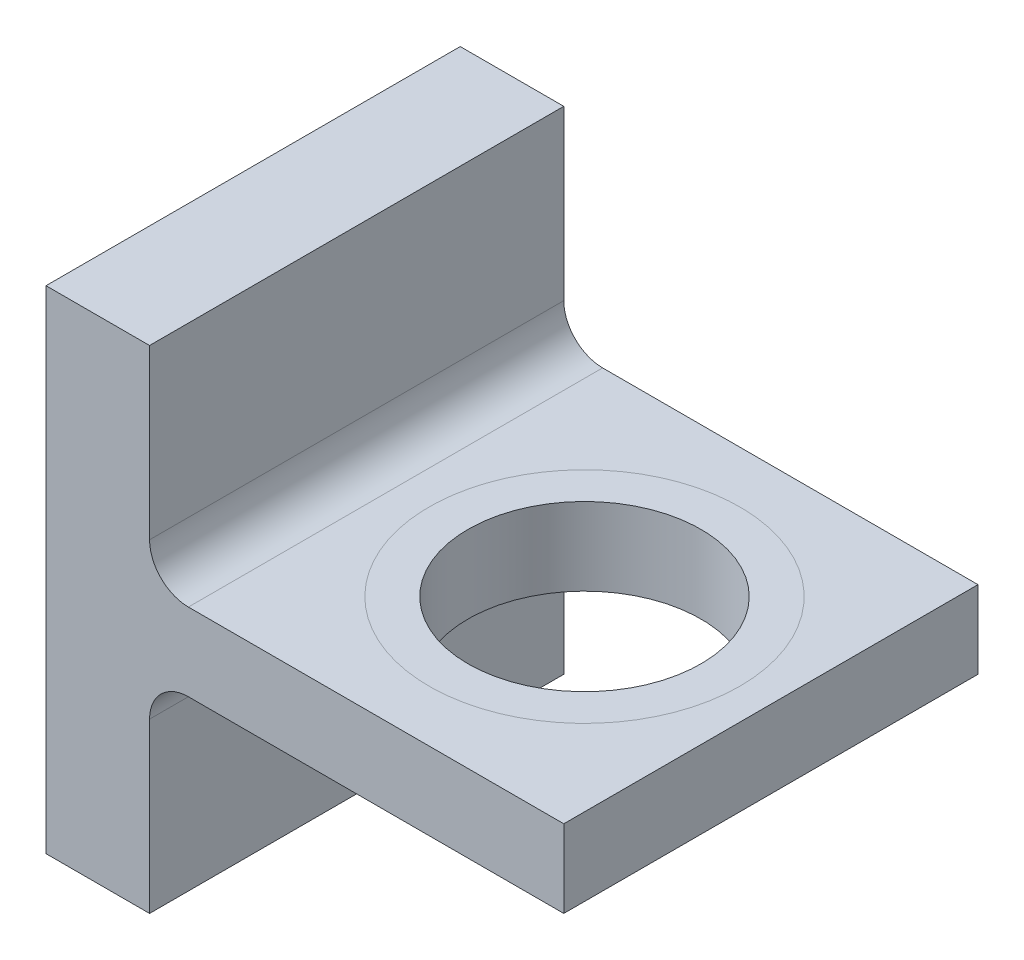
ISO-10303-21;
HEADER;
FILE_DESCRIPTION(('STEP AP214'),'2;1');
FILE_NAME('part.step','',(''),(''),'','','');
FILE_SCHEMA(('AUTOMOTIVE_DESIGN { 1 0 10303 214 1 1 1 1 }'));
ENDSEC;
DATA;
#1=APPLICATION_CONTEXT('core data for automotive mechanical design processes');
#2=APPLICATION_PROTOCOL_DEFINITION('international standard','automotive_design',2000,#1);
#3=PRODUCT_CONTEXT('',#1,'mechanical');
#4=PRODUCT('Part','Part','',(#3));
#5=PRODUCT_RELATED_PRODUCT_CATEGORY('part','',(#4));
#6=PRODUCT_DEFINITION_FORMATION('','',#4);
#7=PRODUCT_DEFINITION_CONTEXT('part definition',#1,'design');
#8=PRODUCT_DEFINITION('design','',#6,#7);
#9=PRODUCT_DEFINITION_SHAPE('','',#8);
#10=(LENGTH_UNIT() NAMED_UNIT(*) SI_UNIT(.MILLI.,.METRE.));
#11=(NAMED_UNIT(*) PLANE_ANGLE_UNIT() SI_UNIT($,.RADIAN.));
#12=(NAMED_UNIT(*) SI_UNIT($,.STERADIAN.) SOLID_ANGLE_UNIT());
#13=UNCERTAINTY_MEASURE_WITH_UNIT(LENGTH_MEASURE(1.E-05),#10,'distance_accuracy_value','');
#14=(GEOMETRIC_REPRESENTATION_CONTEXT(3) GLOBAL_UNCERTAINTY_ASSIGNED_CONTEXT((#13)) GLOBAL_UNIT_ASSIGNED_CONTEXT((#10,
#11,#12)) REPRESENTATION_CONTEXT('',''));
#15=CARTESIAN_POINT('',(0.,0.,0.));
#16=DIRECTION('',(0.,0.,1.));
#17=DIRECTION('',(1.,0.,0.));
#18=AXIS2_PLACEMENT_3D('',#15,#16,#17);
#19=CARTESIAN_POINT('',(25.4,9.525,50.8));
#20=DIRECTION('',(0.,-1.,0.));
#21=DIRECTION('',(1.,0.,0.));
#22=AXIS2_PLACEMENT_3D('',#19,#20,#21);
#23=PLANE('',#22);
#24=DIRECTION('',(-1.,0.,0.));
#25=VECTOR('',#24,1.);
#26=CARTESIAN_POINT('',(25.4,9.525,-50.8));
#27=LINE('',#26,#25);
#28=CARTESIAN_POINT('',(127.,9.525,-50.8));
#29=VERTEX_POINT('',#28);
#30=CARTESIAN_POINT('',(34.925,9.525,-50.8));
#31=VERTEX_POINT('',#30);
#32=EDGE_CURVE('E197',#29,#31,#27,.T.);
#33=ORIENTED_EDGE('',*,*,#32,.T.);
#34=DIRECTION('',(0.,0.,-1.));
#35=VECTOR('',#34,1.);
#36=CARTESIAN_POINT('',(34.925,9.525,50.8));
#37=LINE('',#36,#35);
#38=CARTESIAN_POINT('',(34.925,9.525,50.8));
#39=VERTEX_POINT('',#38);
#40=EDGE_CURVE('E53',#31,#39,#37,.F.);
#41=ORIENTED_EDGE('',*,*,#40,.T.);
#42=DIRECTION('',(-1.,0.,0.));
#43=VECTOR('',#42,1.);
#44=CARTESIAN_POINT('',(25.4,9.525,50.8));
#45=LINE('',#44,#43);
#46=CARTESIAN_POINT('',(127.,9.525,50.8));
#47=VERTEX_POINT('',#46);
#48=EDGE_CURVE('E219',#47,#39,#45,.T.);
#49=ORIENTED_EDGE('',*,*,#48,.F.);
#50=DIRECTION('',(0.,0.,-1.));
#51=VECTOR('',#50,1.);
#52=CARTESIAN_POINT('',(127.,9.525,50.8));
#53=LINE('',#52,#51);
#54=EDGE_CURVE('E207',#47,#29,#53,.T.);
#55=ORIENTED_EDGE('',*,*,#54,.T.);
#56=EDGE_LOOP('',(#33,#41,#49,#55));
#57=FACE_BOUND('',#56,.T.);
#58=CARTESIAN_POINT('',(81.28,9.525,0.));
#59=DIRECTION('',(0.,-1.,0.));
#60=DIRECTION('',(1.,0.,0.));
#61=AXIS2_PLACEMENT_3D('',#58,#59,#60);
#62=CIRCLE('',#61,38.1);
#63=CARTESIAN_POINT('',(119.38,9.525,0.));
#64=VERTEX_POINT('',#63);
#65=EDGE_CURVE('E141',#64,#64,#62,.F.);
#66=ORIENTED_EDGE('',*,*,#65,.F.);
#67=EDGE_LOOP('',(#66));
#68=FACE_BOUND('',#67,.T.);
#69=ADVANCED_FACE('F38',(#57,#68),#23,.F.);
#70=CARTESIAN_POINT('',(0.,60.325,50.8));
#71=DIRECTION('',(1.,0.,0.));
#72=DIRECTION('',(0.,0.,-1.));
#73=AXIS2_PLACEMENT_3D('',#70,#71,#72);
#74=PLANE('',#73);
#75=DIRECTION('',(0.,-1.,0.));
#76=VECTOR('',#75,1.);
#77=CARTESIAN_POINT('',(0.,60.325,-50.8));
#78=LINE('',#77,#76);
#79=CARTESIAN_POINT('',(0.,60.325,-50.8));
#80=VERTEX_POINT('',#79);
#81=CARTESIAN_POINT('',(0.,-60.325,-50.8));
#82=VERTEX_POINT('',#81);
#83=EDGE_CURVE('E140',#80,#82,#78,.T.);
#84=ORIENTED_EDGE('',*,*,#83,.T.);
#85=DIRECTION('',(0.,0.,-1.));
#86=VECTOR('',#85,1.);
#87=CARTESIAN_POINT('',(0.,-60.325,50.8));
#88=LINE('',#87,#86);
#89=CARTESIAN_POINT('',(0.,-60.325,50.8));
#90=VERTEX_POINT('',#89);
#91=EDGE_CURVE('E119',#90,#82,#88,.T.);
#92=ORIENTED_EDGE('',*,*,#91,.F.);
#93=DIRECTION('',(0.,-1.,0.));
#94=VECTOR('',#93,1.);
#95=CARTESIAN_POINT('',(0.,60.325,50.8));
#96=LINE('',#95,#94);
#97=CARTESIAN_POINT('',(0.,60.325,50.8));
#98=VERTEX_POINT('',#97);
#99=EDGE_CURVE('E127',#98,#90,#96,.T.);
#100=ORIENTED_EDGE('',*,*,#99,.F.);
#101=DIRECTION('',(0.,0.,-1.));
#102=VECTOR('',#101,1.);
#103=CARTESIAN_POINT('',(0.,60.325,50.8));
#104=LINE('',#103,#102);
#105=EDGE_CURVE('E202',#98,#80,#104,.T.);
#106=ORIENTED_EDGE('',*,*,#105,.T.);
#107=EDGE_LOOP('',(#84,#92,#100,#106));
#108=FACE_BOUND('',#107,.T.);
#109=ADVANCED_FACE('F138',(#108),#74,.F.);
#110=CARTESIAN_POINT('',(0.,-60.325,50.8));
#111=DIRECTION('',(0.,1.,0.));
#112=DIRECTION('',(0.,0.,1.));
#113=AXIS2_PLACEMENT_3D('',#110,#111,#112);
#114=PLANE('',#113);
#115=DIRECTION('',(1.,0.,0.));
#116=VECTOR('',#115,1.);
#117=CARTESIAN_POINT('',(0.,-60.325,-50.8));
#118=LINE('',#117,#116);
#119=CARTESIAN_POINT('',(25.4,-60.325,-50.8));
#120=VERTEX_POINT('',#119);
#121=EDGE_CURVE('E189',#82,#120,#118,.T.);
#122=ORIENTED_EDGE('',*,*,#121,.T.);
#123=DIRECTION('',(0.,0.,-1.));
#124=VECTOR('',#123,1.);
#125=CARTESIAN_POINT('',(25.4,-60.325,50.8));
#126=LINE('',#125,#124);
#127=CARTESIAN_POINT('',(25.4,-60.325,50.8));
#128=VERTEX_POINT('',#127);
#129=EDGE_CURVE('E122',#128,#120,#126,.T.);
#130=ORIENTED_EDGE('',*,*,#129,.F.);
#131=DIRECTION('',(1.,0.,0.));
#132=VECTOR('',#131,1.);
#133=CARTESIAN_POINT('',(0.,-60.325,50.8));
#134=LINE('',#133,#132);
#135=EDGE_CURVE('E115',#90,#128,#134,.T.);
#136=ORIENTED_EDGE('',*,*,#135,.F.);
#137=ORIENTED_EDGE('',*,*,#91,.T.);
#138=EDGE_LOOP('',(#122,#130,#136,#137));
#139=FACE_BOUND('',#138,.T.);
#140=ADVANCED_FACE('F117',(#139),#114,.F.);
#141=CARTESIAN_POINT('',(25.4,-60.325,50.8));
#142=DIRECTION('',(-1.,0.,0.));
#143=DIRECTION('',(0.,0.,1.));
#144=AXIS2_PLACEMENT_3D('',#141,#142,#143);
#145=PLANE('',#144);
#146=DIRECTION('',(0.,1.,0.));
#147=VECTOR('',#146,1.);
#148=CARTESIAN_POINT('',(25.4,-60.325,-50.8));
#149=LINE('',#148,#147);
#150=CARTESIAN_POINT('',(25.4,-19.05,-50.8));
#151=VERTEX_POINT('',#150);
#152=EDGE_CURVE('E184',#120,#151,#149,.T.);
#153=ORIENTED_EDGE('',*,*,#152,.T.);
#154=DIRECTION('',(0.,0.,-1.));
#155=VECTOR('',#154,1.);
#156=CARTESIAN_POINT('',(25.4,-19.05,50.8));
#157=LINE('',#156,#155);
#158=CARTESIAN_POINT('',(25.4,-19.05,50.8));
#159=VERTEX_POINT('',#158);
#160=EDGE_CURVE('E157',#151,#159,#157,.F.);
#161=ORIENTED_EDGE('',*,*,#160,.T.);
#162=DIRECTION('',(0.,1.,0.));
#163=VECTOR('',#162,1.);
#164=CARTESIAN_POINT('',(25.4,-60.325,50.8));
#165=LINE('',#164,#163);
#166=EDGE_CURVE('E126',#128,#159,#165,.T.);
#167=ORIENTED_EDGE('',*,*,#166,.F.);
#168=ORIENTED_EDGE('',*,*,#129,.T.);
#169=EDGE_LOOP('',(#153,#161,#167,#168));
#170=FACE_BOUND('',#169,.T.);
#171=ADVANCED_FACE('F188',(#170),#145,.F.);
#172=CARTESIAN_POINT('',(25.4,-9.525,50.8));
#173=DIRECTION('',(0.,1.,0.));
#174=DIRECTION('',(-1.,0.,0.));
#175=AXIS2_PLACEMENT_3D('',#172,#173,#174);
#176=PLANE('',#175);
#177=CARTESIAN_POINT('',(81.28,-9.525,0.));
#178=DIRECTION('',(0.,1.,0.));
#179=DIRECTION('',(-1.,0.,0.));
#180=AXIS2_PLACEMENT_3D('',#177,#178,#179);
#181=CIRCLE('',#180,28.575);
#182=CARTESIAN_POINT('',(81.28,-9.52500000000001,28.575));
#183=VERTEX_POINT('',#182);
#184=EDGE_CURVE('E153',#183,#183,#181,.T.);
#185=ORIENTED_EDGE('',*,*,#184,.T.);
#186=EDGE_LOOP('',(#185));
#187=FACE_BOUND('',#186,.T.);
#188=DIRECTION('',(1.,0.,0.));
#189=VECTOR('',#188,1.);
#190=CARTESIAN_POINT('',(25.4,-9.525,50.8));
#191=LINE('',#190,#189);
#192=CARTESIAN_POINT('',(34.925,-9.525,50.8));
#193=VERTEX_POINT('',#192);
#194=CARTESIAN_POINT('',(127.,-9.525,50.8));
#195=VERTEX_POINT('',#194);
#196=EDGE_CURVE('E168',#193,#195,#191,.T.);
#197=ORIENTED_EDGE('',*,*,#196,.F.);
#198=DIRECTION('',(0.,0.,-1.));
#199=VECTOR('',#198,1.);
#200=CARTESIAN_POINT('',(34.925,-9.525,-50.8));
#201=LINE('',#200,#199);
#202=CARTESIAN_POINT('',(34.925,-9.525,-50.8));
#203=VERTEX_POINT('',#202);
#204=EDGE_CURVE('E145',#193,#203,#201,.T.);
#205=ORIENTED_EDGE('',*,*,#204,.T.);
#206=DIRECTION('',(1.,0.,0.));
#207=VECTOR('',#206,1.);
#208=CARTESIAN_POINT('',(25.4,-9.525,-50.8));
#209=LINE('',#208,#207);
#210=CARTESIAN_POINT('',(127.,-9.525,-50.8));
#211=VERTEX_POINT('',#210);
#212=EDGE_CURVE('E186',#203,#211,#209,.T.);
#213=ORIENTED_EDGE('',*,*,#212,.T.);
#214=DIRECTION('',(0.,0.,-1.));
#215=VECTOR('',#214,1.);
#216=CARTESIAN_POINT('',(127.,-9.525,50.8));
#217=LINE('',#216,#215);
#218=EDGE_CURVE('E147',#195,#211,#217,.T.);
#219=ORIENTED_EDGE('',*,*,#218,.F.);
#220=EDGE_LOOP('',(#197,#205,#213,#219));
#221=FACE_BOUND('',#220,.T.);
#222=ADVANCED_FACE('F174',(#187,#221),#176,.F.);
#223=CARTESIAN_POINT('',(127.,9.525,50.8));
#224=DIRECTION('',(-1.,0.,0.));
#225=DIRECTION('',(0.,0.,1.));
#226=AXIS2_PLACEMENT_3D('',#223,#224,#225);
#227=PLANE('',#226);
#228=DIRECTION('',(0.,1.,0.));
#229=VECTOR('',#228,1.);
#230=CARTESIAN_POINT('',(127.,9.525,-50.8));
#231=LINE('',#230,#229);
#232=EDGE_CURVE('E191',#211,#29,#231,.T.);
#233=ORIENTED_EDGE('',*,*,#232,.T.);
#234=ORIENTED_EDGE('',*,*,#54,.F.);
#235=DIRECTION('',(0.,1.,0.));
#236=VECTOR('',#235,1.);
#237=CARTESIAN_POINT('',(127.,9.525,50.8));
#238=LINE('',#237,#236);
#239=EDGE_CURVE('E178',#195,#47,#238,.T.);
#240=ORIENTED_EDGE('',*,*,#239,.F.);
#241=ORIENTED_EDGE('',*,*,#218,.T.);
#242=EDGE_LOOP('',(#233,#234,#240,#241));
#243=FACE_BOUND('',#242,.T.);
#244=ADVANCED_FACE('F210',(#243),#227,.F.);
#245=ORIENTED_EDGE('',*,*,#65,.T.);
#246=EDGE_LOOP('',(#245));
#247=FACE_BOUND('',#246,.T.);
#248=CARTESIAN_POINT('',(81.28,9.525,0.));
#249=DIRECTION('',(0.,-1.,0.));
#250=DIRECTION('',(1.,0.,0.));
#251=AXIS2_PLACEMENT_3D('',#248,#249,#250);
#252=CIRCLE('',#251,28.575);
#253=CARTESIAN_POINT('',(81.28,9.52500000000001,28.575));
#254=VERTEX_POINT('',#253);
#255=EDGE_CURVE('E151',#254,#254,#252,.T.);
#256=ORIENTED_EDGE('',*,*,#255,.T.);
#257=EDGE_LOOP('',(#256));
#258=FACE_BOUND('',#257,.T.);
#259=ADVANCED_FACE('F245',(#247,#258),#23,.F.);
#260=CARTESIAN_POINT('',(25.4,60.325,50.8));
#261=DIRECTION('',(-1.,0.,0.));
#262=DIRECTION('',(0.,0.,1.));
#263=AXIS2_PLACEMENT_3D('',#260,#261,#262);
#264=PLANE('',#263);
#265=DIRECTION('',(0.,1.,0.));
#266=VECTOR('',#265,1.);
#267=CARTESIAN_POINT('',(25.4,60.325,50.8));
#268=LINE('',#267,#266);
#269=CARTESIAN_POINT('',(25.4,19.05,50.8));
#270=VERTEX_POINT('',#269);
#271=CARTESIAN_POINT('',(25.4,60.325,50.8));
#272=VERTEX_POINT('',#271);
#273=EDGE_CURVE('E217',#270,#272,#268,.T.);
#274=ORIENTED_EDGE('',*,*,#273,.F.);
#275=DIRECTION('',(0.,0.,-1.));
#276=VECTOR('',#275,1.);
#277=CARTESIAN_POINT('',(25.4,19.05,-50.8));
#278=LINE('',#277,#276);
#279=CARTESIAN_POINT('',(25.4,19.05,-50.8));
#280=VERTEX_POINT('',#279);
#281=EDGE_CURVE('E159',#270,#280,#278,.T.);
#282=ORIENTED_EDGE('',*,*,#281,.T.);
#283=DIRECTION('',(0.,1.,0.));
#284=VECTOR('',#283,1.);
#285=CARTESIAN_POINT('',(25.4,60.325,-50.8));
#286=LINE('',#285,#284);
#287=CARTESIAN_POINT('',(25.4,60.325,-50.8));
#288=VERTEX_POINT('',#287);
#289=EDGE_CURVE('E199',#280,#288,#286,.T.);
#290=ORIENTED_EDGE('',*,*,#289,.T.);
#291=DIRECTION('',(0.,0.,-1.));
#292=VECTOR('',#291,1.);
#293=CARTESIAN_POINT('',(25.4,60.325,50.8));
#294=LINE('',#293,#292);
#295=EDGE_CURVE('E204',#272,#288,#294,.T.);
#296=ORIENTED_EDGE('',*,*,#295,.F.);
#297=EDGE_LOOP('',(#274,#282,#290,#296));
#298=FACE_BOUND('',#297,.T.);
#299=ADVANCED_FACE('F221',(#298),#264,.F.);
#300=CARTESIAN_POINT('',(0.,60.325,50.8));
#301=DIRECTION('',(0.,-1.,0.));
#302=DIRECTION('',(0.,0.,-1.));
#303=AXIS2_PLACEMENT_3D('',#300,#301,#302);
#304=PLANE('',#303);
#305=DIRECTION('',(-1.,0.,0.));
#306=VECTOR('',#305,1.);
#307=CARTESIAN_POINT('',(0.,60.325,-50.8));
#308=LINE('',#307,#306);
#309=EDGE_CURVE('E136',#288,#80,#308,.T.);
#310=ORIENTED_EDGE('',*,*,#309,.T.);
#311=ORIENTED_EDGE('',*,*,#105,.F.);
#312=DIRECTION('',(-1.,0.,0.));
#313=VECTOR('',#312,1.);
#314=CARTESIAN_POINT('',(0.,60.325,50.8));
#315=LINE('',#314,#313);
#316=EDGE_CURVE('E132',#272,#98,#315,.T.);
#317=ORIENTED_EDGE('',*,*,#316,.F.);
#318=ORIENTED_EDGE('',*,*,#295,.T.);
#319=EDGE_LOOP('',(#310,#311,#317,#318));
#320=FACE_BOUND('',#319,.T.);
#321=ADVANCED_FACE('F258',(#320),#304,.F.);
#322=CARTESIAN_POINT('',(0.,-60.325,50.8));
#323=DIRECTION('',(0.,0.,1.));
#324=DIRECTION('',(1.,0.,0.));
#325=AXIS2_PLACEMENT_3D('',#322,#323,#324);
#326=PLANE('',#325);
#327=ORIENTED_EDGE('',*,*,#99,.T.);
#328=ORIENTED_EDGE('',*,*,#135,.T.);
#329=ORIENTED_EDGE('',*,*,#166,.T.);
#330=CARTESIAN_POINT('',(34.925,-19.05,50.8));
#331=DIRECTION('',(0.,0.,1.));
#332=DIRECTION('',(1.,0.,0.));
#333=AXIS2_PLACEMENT_3D('',#330,#331,#332);
#334=CIRCLE('',#333,9.525);
#335=EDGE_CURVE('E165',#159,#193,#334,.F.);
#336=ORIENTED_EDGE('',*,*,#335,.T.);
#337=ORIENTED_EDGE('',*,*,#196,.T.);
#338=ORIENTED_EDGE('',*,*,#239,.T.);
#339=ORIENTED_EDGE('',*,*,#48,.T.);
#340=CARTESIAN_POINT('',(34.925,19.05,50.8));
#341=DIRECTION('',(0.,0.,1.));
#342=DIRECTION('',(1.,0.,0.));
#343=AXIS2_PLACEMENT_3D('',#340,#341,#342);
#344=CIRCLE('',#343,9.525);
#345=EDGE_CURVE('E11',#39,#270,#344,.F.);
#346=ORIENTED_EDGE('',*,*,#345,.T.);
#347=ORIENTED_EDGE('',*,*,#273,.T.);
#348=ORIENTED_EDGE('',*,*,#316,.T.);
#349=EDGE_LOOP('',(#327,#328,#329,#336,#337,#338,#339,#346,#347,#348));
#350=FACE_BOUND('',#349,.T.);
#351=ADVANCED_FACE('F130',(#350),#326,.T.);
#352=CARTESIAN_POINT('',(0.,-60.325,-50.8));
#353=DIRECTION('',(0.,0.,1.));
#354=DIRECTION('',(1.,0.,0.));
#355=AXIS2_PLACEMENT_3D('',#352,#353,#354);
#356=PLANE('',#355);
#357=ORIENTED_EDGE('',*,*,#83,.F.);
#358=ORIENTED_EDGE('',*,*,#309,.F.);
#359=ORIENTED_EDGE('',*,*,#289,.F.);
#360=CARTESIAN_POINT('',(34.925,19.05,-50.8));
#361=DIRECTION('',(0.,0.,1.));
#362=DIRECTION('',(1.,0.,0.));
#363=AXIS2_PLACEMENT_3D('',#360,#361,#362);
#364=CIRCLE('',#363,9.525);
#365=EDGE_CURVE('E46',#280,#31,#364,.T.);
#366=ORIENTED_EDGE('',*,*,#365,.T.);
#367=ORIENTED_EDGE('',*,*,#32,.F.);
#368=ORIENTED_EDGE('',*,*,#232,.F.);
#369=ORIENTED_EDGE('',*,*,#212,.F.);
#370=CARTESIAN_POINT('',(34.925,-19.05,-50.8));
#371=DIRECTION('',(0.,0.,1.));
#372=DIRECTION('',(1.,0.,0.));
#373=AXIS2_PLACEMENT_3D('',#370,#371,#372);
#374=CIRCLE('',#373,9.525);
#375=EDGE_CURVE('E163',#203,#151,#374,.T.);
#376=ORIENTED_EDGE('',*,*,#375,.T.);
#377=ORIENTED_EDGE('',*,*,#152,.F.);
#378=ORIENTED_EDGE('',*,*,#121,.F.);
#379=EDGE_LOOP('',(#357,#358,#359,#366,#367,#368,#369,#376,#377,#378));
#380=FACE_BOUND('',#379,.T.);
#381=ADVANCED_FACE('F183',(#380),#356,.F.);
#382=CARTESIAN_POINT('',(81.28,-60.325,0.));
#383=DIRECTION('',(0.,1.,0.));
#384=DIRECTION('',(0.,0.,1.));
#385=AXIS2_PLACEMENT_3D('',#382,#383,#384);
#386=CYLINDRICAL_SURFACE('',#385,28.575);
#387=CARTESIAN_POINT('',(81.28,9.52500000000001,28.575));
#388=CARTESIAN_POINT('',(81.28,9.32656250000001,28.575));
#389=CARTESIAN_POINT('',(81.28,9.12812500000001,28.575));
#390=CARTESIAN_POINT('',(81.28,8.73125000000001,28.575));
#391=CARTESIAN_POINT('',(81.28,8.53281250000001,28.575));
#392=CARTESIAN_POINT('',(81.28,8.13593750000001,28.575));
#393=CARTESIAN_POINT('',(81.28,7.93750000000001,28.575));
#394=CARTESIAN_POINT('',(81.28,7.54062500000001,28.575));
#395=CARTESIAN_POINT('',(81.28,7.34218750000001,28.575));
#396=CARTESIAN_POINT('',(81.28,6.94531250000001,28.575));
#397=CARTESIAN_POINT('',(81.28,6.74687500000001,28.575));
#398=CARTESIAN_POINT('',(81.28,6.35000000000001,28.575));
#399=CARTESIAN_POINT('',(81.28,6.15156250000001,28.575));
#400=CARTESIAN_POINT('',(81.28,5.75468750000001,28.575));
#401=CARTESIAN_POINT('',(81.28,5.55625000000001,28.575));
#402=CARTESIAN_POINT('',(81.28,5.15937500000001,28.575));
#403=CARTESIAN_POINT('',(81.28,4.96093750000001,28.575));
#404=CARTESIAN_POINT('',(81.28,4.56406250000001,28.575));
#405=CARTESIAN_POINT('',(81.28,4.36562500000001,28.575));
#406=CARTESIAN_POINT('',(81.28,3.96875000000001,28.575));
#407=CARTESIAN_POINT('',(81.28,3.77031250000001,28.575));
#408=CARTESIAN_POINT('',(81.28,3.37343750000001,28.575));
#409=CARTESIAN_POINT('',(81.28,3.17500000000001,28.575));
#410=CARTESIAN_POINT('',(81.28,2.77812500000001,28.575));
#411=CARTESIAN_POINT('',(81.28,2.57968750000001,28.575));
#412=CARTESIAN_POINT('',(81.28,2.18281250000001,28.575));
#413=CARTESIAN_POINT('',(81.28,1.98437500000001,28.575));
#414=CARTESIAN_POINT('',(81.28,1.58750000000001,28.575));
#415=CARTESIAN_POINT('',(81.28,1.38906250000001,28.575));
#416=CARTESIAN_POINT('',(81.28,0.992187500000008,28.575));
#417=CARTESIAN_POINT('',(81.28,0.793750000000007,28.575));
#418=CARTESIAN_POINT('',(81.28,0.396875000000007,28.575));
#419=CARTESIAN_POINT('',(81.28,0.198437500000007,28.575));
#420=CARTESIAN_POINT('',(81.28,-0.198437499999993,28.575));
#421=CARTESIAN_POINT('',(81.28,-0.396874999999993,28.575));
#422=CARTESIAN_POINT('',(81.28,-0.793749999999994,28.575));
#423=CARTESIAN_POINT('',(81.28,-0.992187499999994,28.575));
#424=CARTESIAN_POINT('',(81.28,-1.38906249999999,28.575));
#425=CARTESIAN_POINT('',(81.28,-1.58749999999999,28.575));
#426=CARTESIAN_POINT('',(81.28,-1.98437499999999,28.575));
#427=CARTESIAN_POINT('',(81.28,-2.18281249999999,28.575));
#428=CARTESIAN_POINT('',(81.28,-2.57968749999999,28.575));
#429=CARTESIAN_POINT('',(81.28,-2.77812499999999,28.575));
#430=CARTESIAN_POINT('',(81.28,-3.175,28.575));
#431=CARTESIAN_POINT('',(81.28,-3.3734375,28.575));
#432=CARTESIAN_POINT('',(81.28,-3.7703125,28.575));
#433=CARTESIAN_POINT('',(81.28,-3.96875,28.575));
#434=CARTESIAN_POINT('',(81.28,-4.365625,28.575));
#435=CARTESIAN_POINT('',(81.28,-4.5640625,28.575));
#436=CARTESIAN_POINT('',(81.28,-4.9609375,28.575));
#437=CARTESIAN_POINT('',(81.28,-5.159375,28.575));
#438=CARTESIAN_POINT('',(81.28,-5.55625,28.575));
#439=CARTESIAN_POINT('',(81.28,-5.7546875,28.575));
#440=CARTESIAN_POINT('',(81.28,-6.1515625,28.575));
#441=CARTESIAN_POINT('',(81.28,-6.35,28.575));
#442=CARTESIAN_POINT('',(81.28,-6.746875,28.575));
#443=CARTESIAN_POINT('',(81.28,-6.9453125,28.575));
#444=CARTESIAN_POINT('',(81.28,-7.3421875,28.575));
#445=CARTESIAN_POINT('',(81.28,-7.540625,28.575));
#446=CARTESIAN_POINT('',(81.28,-7.93750000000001,28.575));
#447=CARTESIAN_POINT('',(81.28,-8.1359375,28.575));
#448=CARTESIAN_POINT('',(81.28,-8.53281250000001,28.575));
#449=CARTESIAN_POINT('',(81.28,-8.73125,28.575));
#450=CARTESIAN_POINT('',(81.28,-9.12812500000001,28.575));
#451=CARTESIAN_POINT('',(81.28,-9.3265625,28.575));
#452=CARTESIAN_POINT('',(81.28,-9.52500000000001,28.575));
#453=B_SPLINE_CURVE_WITH_KNOTS('',3,(#387,#388,#389,#390,#391,#392,#393,#394,#395,#396,#397,
#398,#399,#400,#401,#402,#403,#404,#405,#406,#407,#408,#409,#410,#411,#412,#413,#414,#415,#416,
#417,#418,#419,#420,#421,#422,#423,#424,#425,#426,#427,#428,#429,#430,#431,#432,#433,#434,#435,
#436,#437,#438,#439,#440,#441,#442,#443,#444,#445,#446,#447,#448,#449,#450,#451,#452),
.UNSPECIFIED.,.F.,.F.,(4,2,2,2,2,2,2,2,2,2,2,2,2,2,2,2,2,2,2,2,2,2,2,2,2,2,2,2,2,2,2,2,4),(0.,
0.5953125,1.190625,1.7859375,2.38125,2.9765625,3.571875,4.1671875,4.7625,5.3578125,5.953125,
6.5484375,7.14375,7.7390625,8.334375,8.92968750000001,9.52500000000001,10.1203125,10.715625,
11.3109375,11.90625,12.5015625,13.096875,13.6921875,14.2875,14.8828125,15.478125,16.0734375,
16.66875,17.2640625,17.859375,18.4546875,19.05),.UNSPECIFIED.);
#454=EDGE_CURVE('BSEAM232',#254,#183,#453,.T.);
#455=ORIENTED_EDGE('',*,*,#255,.F.);
#456=ORIENTED_EDGE('',*,*,#184,.F.);
#457=ORIENTED_EDGE('',*,*,#454,.T.);
#458=ORIENTED_EDGE('',*,*,#454,.F.);
#459=EDGE_LOOP('',(#455,#457,#456,#458));
#460=FACE_BOUND('',#459,.T.);
#461=ADVANCED_FACE('F232',(#460),#386,.F.);
#462=CARTESIAN_POINT('',(34.925,-19.05,50.8));
#463=DIRECTION('',(0.,0.,1.));
#464=DIRECTION('',(1.,0.,0.));
#465=AXIS2_PLACEMENT_3D('',#462,#463,#464);
#466=CYLINDRICAL_SURFACE('',#465,9.525);
#467=ORIENTED_EDGE('',*,*,#335,.F.);
#468=ORIENTED_EDGE('',*,*,#160,.F.);
#469=ORIENTED_EDGE('',*,*,#375,.F.);
#470=ORIENTED_EDGE('',*,*,#204,.F.);
#471=EDGE_LOOP('',(#467,#468,#469,#470));
#472=FACE_BOUND('',#471,.T.);
#473=ADVANCED_FACE('F180',(#472),#466,.F.);
#474=CARTESIAN_POINT('',(34.925,19.05,50.8));
#475=DIRECTION('',(0.,0.,1.));
#476=DIRECTION('',(1.,0.,0.));
#477=AXIS2_PLACEMENT_3D('',#474,#475,#476);
#478=CYLINDRICAL_SURFACE('',#477,9.525);
#479=ORIENTED_EDGE('',*,*,#345,.F.);
#480=ORIENTED_EDGE('',*,*,#40,.F.);
#481=ORIENTED_EDGE('',*,*,#365,.F.);
#482=ORIENTED_EDGE('',*,*,#281,.F.);
#483=EDGE_LOOP('',(#479,#480,#481,#482));
#484=FACE_BOUND('',#483,.T.);
#485=ADVANCED_FACE('F40',(#484),#478,.F.);
#486=CLOSED_SHELL('',(#69,#109,#140,#171,#222,#244,#259,#299,#321,#351,#381,#461,#473,#485));
#487=MANIFOLD_SOLID_BREP('B2',#486);
#488=ADVANCED_BREP_SHAPE_REPRESENTATION('',(#18,#487),#14);
#489=SHAPE_DEFINITION_REPRESENTATION(#9,#488);
ENDSEC;
END-ISO-10303-21;
